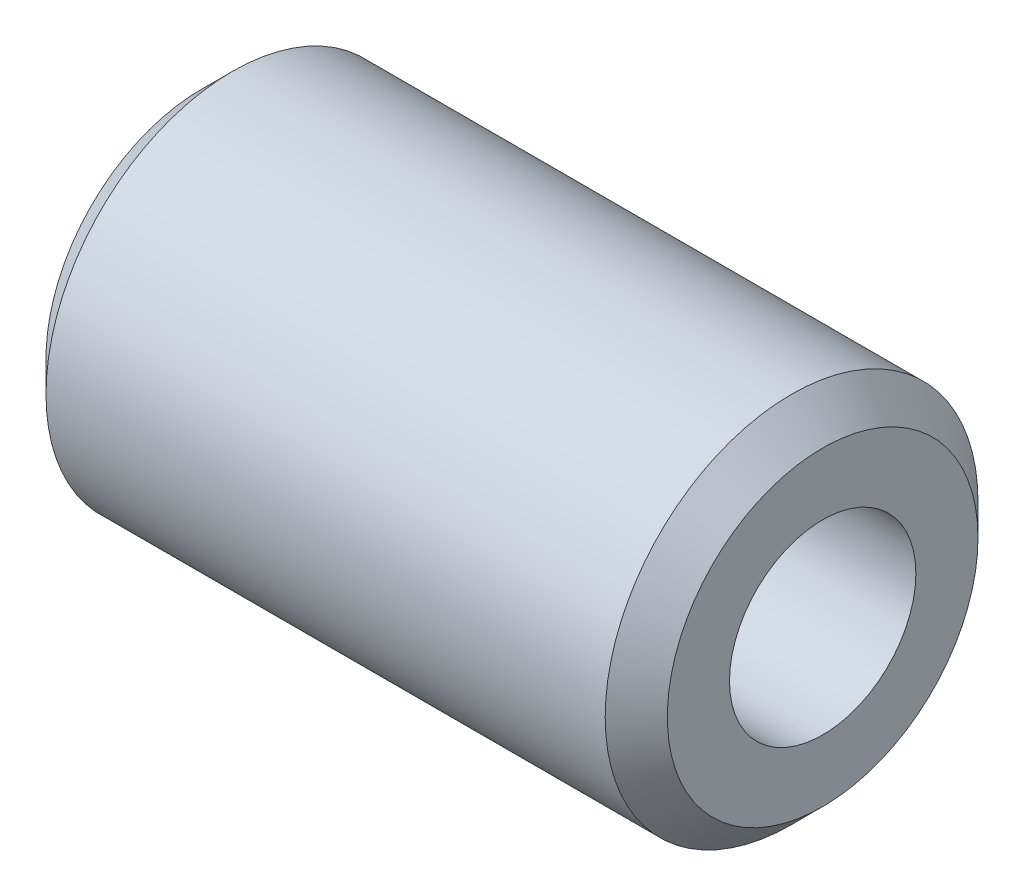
from build123d import *

# Parameters (mm, degrees)
ESQUISSE1_R             = 6
BASE_EXTRUSION_DEPTH    = 20
CHANFREIN1_SIZE         = 1
ESQUISSE4_R             = 2.5
ENL_V_MAT_EXTRU_2_DEPTH = 15
ESQUISSE5_R             = 3
ENL_V_MAT_EXTRU_3_DEPTH = 12


with BuildPart() as part:
    # Esquisse1 → Base-Extrusion (new body)
    with BuildSketch(Plane(origin=(0, 0, 0), x_dir=(0, 0, -1), z_dir=(1, 0, 0))):
        Circle(ESQUISSE1_R)
    extrude(amount=BASE_EXTRUSION_DEPTH)

    # Chanfrein1
    chanfrein1_edges = [part.edges().sort_by_distance(p)[0] for p in [
        (0, 0, 6),
        (20, 0, 6),
    ]]
    chamfer(chanfrein1_edges, length=CHANFREIN1_SIZE)

    # Esquisse4 → Enl_v. mat.-Extru.2 (cut)
    with BuildSketch(Plane(origin=(20, 0, 0), x_dir=(0, 0, -1), z_dir=(1, 0, 0))):
        Circle(ESQUISSE4_R)
    extrude(amount=-ENL_V_MAT_EXTRU_2_DEPTH, mode=Mode.SUBTRACT)

    # Esquisse5 → Enl_v. mat.-Extru.3 (cut)
    with BuildSketch(Plane(origin=(20, 0, 0), x_dir=(0, 0, -1), z_dir=(1, 0, 0))):
        Circle(ESQUISSE5_R)
    extrude(amount=-ENL_V_MAT_EXTRU_3_DEPTH, mode=Mode.SUBTRACT)


solid = part.part
